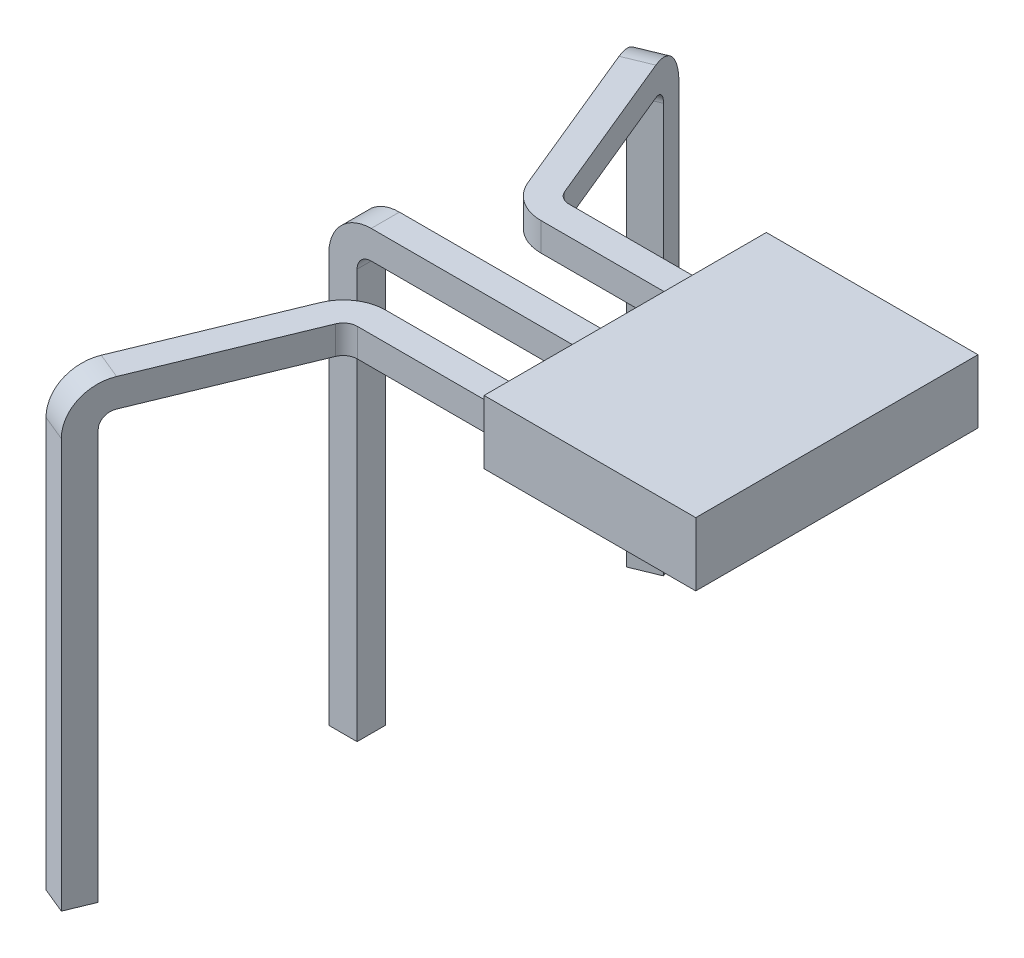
from build123d import *

# Parameters (mm, degrees)
ESQUISSE1_W           = 3
ESQUISSE1_H           = 4
EXTRUSION1_DEPTH      = 1.5
CHANFREIN1_SIZE       = 0.6
EXTRUSION2_DEPTH      = 6
CONG_1_R              = 0.6
CONG_2_R              = 0.2
CONG_1_OF_SYM_TRIE1_R = 0.6
CONG_2_OF_SYM_TRIE1_R = 0.2
ESQUISSE8_W           = 0.3999999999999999
ESQUISSE8_H           = 0.4000000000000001
EXTRUSION3_DEPTH      = 6
CONG_3_R              = 0.2
CONG_4_R              = 0.6


with BuildPart() as part:
    # Esquisse1 → Extrusion1 (new body)
    with BuildSketch(Plane(origin=(0, 0, 0), x_dir=(1, 0, 0), z_dir=(0, 1, 0))):
        with Locations((1.5, 0)):
            Rectangle(ESQUISSE1_W, ESQUISSE1_H)
    extrude(amount=EXTRUSION1_DEPTH)

    # Chanfrein1
    chanfrein1_edges = [part.edges().sort_by_distance(p)[0] for p in [
        (1.5, 0, -2),
        (3, 0, 0),
        (1.5, 0, 2),
    ]]
    chamfer(chanfrein1_edges, length=CHANFREIN1_SIZE)

    # Balayage1: sweep along a path in Esquisse2
    with BuildLine(Plane(origin=(0, 0.75, 0), x_dir=(-1, 0, 0), z_dir=(0, 1, 0))) as balayage1_path:
        Line((0, 1.3), (2.5639213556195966, 1.3))
        Line((2.5639213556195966, 1.3), (3.7999999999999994, 4.3))
    # Esquisse3 → Balayage1 (sweep)
    with BuildSketch(Plane.ZY):
        Polygon((1.0999999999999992, 0.9499999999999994), (1.499999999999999, 0.950000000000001), (1.5000000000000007, 0.550000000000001), (1.100000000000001, 0.5499999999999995), align=None)
    balayage1 = sweep(path=balayage1_path.line, transition=Transition.RIGHT)

    # Esquisse4 → Extrusion2 (add)
    with BuildSketch(Plane.XZ.offset(-0.5499999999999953)):
        Polygon((-3.6150814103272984, 4.376191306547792), (-3.9849185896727, 4.223808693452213), (-3.832535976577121, 3.8539715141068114), (-3.4626987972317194, 4.00635412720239), align=None)
    extrusion2 = extrude(amount=EXTRUSION2_DEPTH)

    # Cong_1
    cong_1_edges = [part.edges().sort_by_distance(p)[0] for p in [
        (-2.6978275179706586, 0.7499999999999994, 1.1),
        (-3.8000000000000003, 0.9500000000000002, 4.3),
    ]]
    fillet(cong_1_edges, radius=CONG_1_R)

    # Cong_2
    cong_2_edges = [part.edges().sort_by_distance(p)[0] for p in [
        (-2.430015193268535, 0.750000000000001, 1.4999999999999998),
        (-3.64761738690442, 0.5500000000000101, 3.930162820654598),
    ]]
    fillet(cong_2_edges, radius=CONG_2_R)

    # Sym_trie1: Balayage1, Extrusion2 across plane
    add(balayage1.mirror(Plane.XY))
    add(extrusion2.mirror(Plane.XY))

    # Cong_1 of Sym_trie1
    cong_1_of_sym_trie1_edges = [part.edges().sort_by_distance(p)[0] for p in [
        (-2.6978275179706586, 0.7499999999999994, -1.1),
        (-3.8000000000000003, 0.9500000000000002, -4.3),
    ]]
    fillet(cong_1_of_sym_trie1_edges, radius=CONG_1_OF_SYM_TRIE1_R)

    # Cong_2 of Sym_trie1
    cong_2_of_sym_trie1_edges = [part.edges().sort_by_distance(p)[0] for p in [
        (-2.430015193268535, 0.750000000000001, -1.4999999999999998),
        (-3.64761738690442, 0.5500000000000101, -3.930162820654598),
    ]]
    fillet(cong_2_of_sym_trie1_edges, radius=CONG_2_OF_SYM_TRIE1_R)

    # Balayage2: sweep along a path in Esquisse6
    with BuildLine(Plane(origin=(0, 0.75, 0), x_dir=(-1, 0, 0), z_dir=(0, 1, 0))) as balayage2_path:
        Line((0, 0), (4, 0))
    # Esquisse7 → Balayage2 (sweep)
    with BuildSketch(Plane.ZY):
        Polygon((-0.2000000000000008, 0.5500000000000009), (0.19999999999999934, 0.5499999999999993), (0.20000000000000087, 0.9499999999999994), (-0.1999999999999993, 0.9500000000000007), align=None)
    sweep(path=balayage2_path.line)

    # Esquisse8 → Extrusion3 (add)
    with BuildSketch(Plane.XZ.offset(-0.55)):
        with Locations((-3.8, -3.03e-15)):
            Rectangle(ESQUISSE8_W, ESQUISSE8_H)
    extrude(amount=EXTRUSION3_DEPTH)

    # Cong_3
    cong_3_edges = [part.edges().sort_by_distance(p)[0] for p in [
        (-3.6, 0.55, -7.6e-16),
    ]]
    fillet(cong_3_edges, radius=CONG_3_R)

    # Cong_4
    cong_4_edges = [part.edges().sort_by_distance(p)[0] for p in [
        (-4, 0.9500000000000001, 8e-16),
    ]]
    fillet(cong_4_edges, radius=CONG_4_R)


solid = part.part
